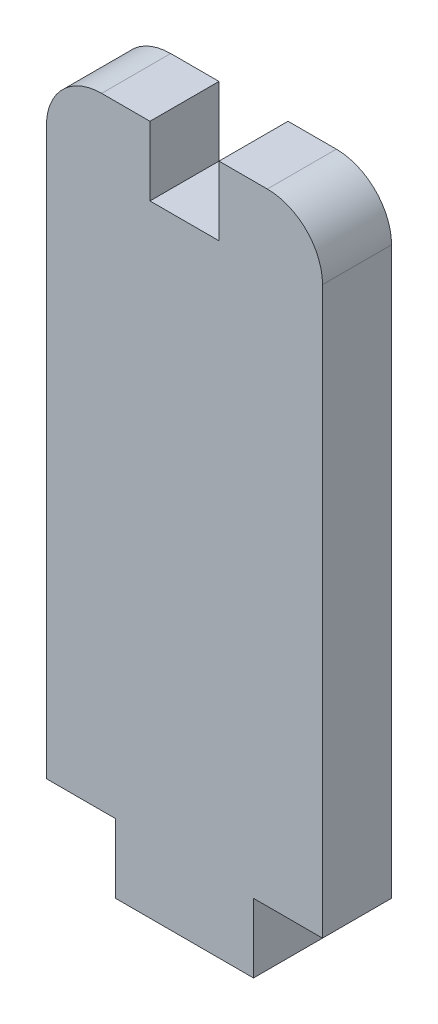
ISO-10303-21;
HEADER;
FILE_DESCRIPTION(('STEP AP214'),'2;1');
FILE_NAME('part.step','',(''),(''),'','','');
FILE_SCHEMA(('AUTOMOTIVE_DESIGN { 1 0 10303 214 1 1 1 1 }'));
ENDSEC;
DATA;
#1=APPLICATION_CONTEXT('core data for automotive mechanical design processes');
#2=APPLICATION_PROTOCOL_DEFINITION('international standard','automotive_design',2000,#1);
#3=PRODUCT_CONTEXT('',#1,'mechanical');
#4=PRODUCT('Part','Part','',(#3));
#5=PRODUCT_RELATED_PRODUCT_CATEGORY('part','',(#4));
#6=PRODUCT_DEFINITION_FORMATION('','',#4);
#7=PRODUCT_DEFINITION_CONTEXT('part definition',#1,'design');
#8=PRODUCT_DEFINITION('design','',#6,#7);
#9=PRODUCT_DEFINITION_SHAPE('','',#8);
#10=(LENGTH_UNIT() NAMED_UNIT(*) SI_UNIT(.MILLI.,.METRE.));
#11=(NAMED_UNIT(*) PLANE_ANGLE_UNIT() SI_UNIT($,.RADIAN.));
#12=(NAMED_UNIT(*) SI_UNIT($,.STERADIAN.) SOLID_ANGLE_UNIT());
#13=UNCERTAINTY_MEASURE_WITH_UNIT(LENGTH_MEASURE(1.E-05),#10,'distance_accuracy_value','');
#14=(GEOMETRIC_REPRESENTATION_CONTEXT(3) GLOBAL_UNCERTAINTY_ASSIGNED_CONTEXT((#13)) GLOBAL_UNIT_ASSIGNED_CONTEXT((#10,
#11,#12)) REPRESENTATION_CONTEXT('',''));
#15=CARTESIAN_POINT('',(0.,0.,0.));
#16=DIRECTION('',(0.,0.,1.));
#17=DIRECTION('',(1.,0.,0.));
#18=AXIS2_PLACEMENT_3D('',#15,#16,#17);
#19=CARTESIAN_POINT('',(-6.35,15.875,1.5875));
#20=DIRECTION('',(0.,-1.,0.));
#21=DIRECTION('',(0.,0.,-1.));
#22=AXIS2_PLACEMENT_3D('',#19,#20,#21);
#23=PLANE('',#22);
#24=DIRECTION('',(-1.,0.,0.));
#25=VECTOR('',#24,1.);
#26=CARTESIAN_POINT('',(-6.35,15.875,1.5875));
#27=LINE('',#26,#25);
#28=CARTESIAN_POINT('',(3.81,15.875,1.5875));
#29=VERTEX_POINT('',#28);
#30=CARTESIAN_POINT('',(1.5875,15.875,1.5875));
#31=VERTEX_POINT('',#30);
#32=EDGE_CURVE('E217',#29,#31,#27,.T.);
#33=ORIENTED_EDGE('',*,*,#32,.F.);
#34=DIRECTION('',(0.,0.,-1.));
#35=VECTOR('',#34,1.);
#36=CARTESIAN_POINT('',(3.81,15.875,1.5875));
#37=LINE('',#36,#35);
#38=CARTESIAN_POINT('',(3.81,15.875,-1.5875));
#39=VERTEX_POINT('',#38);
#40=EDGE_CURVE('E138',#29,#39,#37,.T.);
#41=ORIENTED_EDGE('',*,*,#40,.T.);
#42=DIRECTION('',(-1.,0.,0.));
#43=VECTOR('',#42,1.);
#44=CARTESIAN_POINT('',(-6.35,15.875,-1.5875));
#45=LINE('',#44,#43);
#46=CARTESIAN_POINT('',(1.5875,15.875,-1.5875));
#47=VERTEX_POINT('',#46);
#48=EDGE_CURVE('E133',#39,#47,#45,.T.);
#49=ORIENTED_EDGE('',*,*,#48,.T.);
#50=DIRECTION('',(0.,0.,1.));
#51=VECTOR('',#50,1.);
#52=CARTESIAN_POINT('',(1.5875,15.875,-1.5875));
#53=LINE('',#52,#51);
#54=EDGE_CURVE('E136',#47,#31,#53,.T.);
#55=ORIENTED_EDGE('',*,*,#54,.T.);
#56=EDGE_LOOP('',(#33,#41,#49,#55));
#57=FACE_BOUND('',#56,.T.);
#58=ADVANCED_FACE('F31',(#57),#23,.F.);
#59=CARTESIAN_POINT('',(6.35,15.875,1.5875));
#60=DIRECTION('',(-1.,0.,0.));
#61=DIRECTION('',(0.,-1.,0.));
#62=AXIS2_PLACEMENT_3D('',#59,#60,#61);
#63=PLANE('',#62);
#64=DIRECTION('',(0.,1.,0.));
#65=VECTOR('',#64,1.);
#66=CARTESIAN_POINT('',(6.35,15.875,-1.5875));
#67=LINE('',#66,#65);
#68=CARTESIAN_POINT('',(6.35,-12.7,-1.5875));
#69=VERTEX_POINT('',#68);
#70=CARTESIAN_POINT('',(6.35,13.335,-1.5875));
#71=VERTEX_POINT('',#70);
#72=EDGE_CURVE('E208',#69,#71,#67,.T.);
#73=ORIENTED_EDGE('',*,*,#72,.T.);
#74=DIRECTION('',(0.,0.,-1.));
#75=VECTOR('',#74,1.);
#76=CARTESIAN_POINT('',(6.35,13.335,1.5875));
#77=LINE('',#76,#75);
#78=CARTESIAN_POINT('',(6.35,13.335,1.5875));
#79=VERTEX_POINT('',#78);
#80=EDGE_CURVE('E234',#71,#79,#77,.F.);
#81=ORIENTED_EDGE('',*,*,#80,.T.);
#82=DIRECTION('',(0.,1.,0.));
#83=VECTOR('',#82,1.);
#84=CARTESIAN_POINT('',(6.35,15.875,1.5875));
#85=LINE('',#84,#83);
#86=CARTESIAN_POINT('',(6.35,-12.7,1.5875));
#87=VERTEX_POINT('',#86);
#88=EDGE_CURVE('E212',#87,#79,#85,.T.);
#89=ORIENTED_EDGE('',*,*,#88,.F.);
#90=DIRECTION('',(0.,0.,1.));
#91=VECTOR('',#90,1.);
#92=CARTESIAN_POINT('',(6.35,-12.7,-1.5875));
#93=LINE('',#92,#91);
#94=EDGE_CURVE('E182',#69,#87,#93,.T.);
#95=ORIENTED_EDGE('',*,*,#94,.F.);
#96=EDGE_LOOP('',(#73,#81,#89,#95));
#97=FACE_BOUND('',#96,.T.);
#98=ADVANCED_FACE('F273',(#97),#63,.F.);
#99=CARTESIAN_POINT('',(-1.5875,15.875,-1.5875));
#100=VERTEX_POINT('',#99);
#101=CARTESIAN_POINT('',(-3.81,15.875,-1.5875));
#102=VERTEX_POINT('',#101);
#103=EDGE_CURVE('E142',#100,#102,#45,.T.);
#104=ORIENTED_EDGE('',*,*,#103,.T.);
#105=DIRECTION('',(0.,0.,-1.));
#106=VECTOR('',#105,1.);
#107=CARTESIAN_POINT('',(-3.81,15.875,1.5875));
#108=LINE('',#107,#106);
#109=CARTESIAN_POINT('',(-3.81,15.875,1.5875));
#110=VERTEX_POINT('',#109);
#111=EDGE_CURVE('E11',#102,#110,#108,.F.);
#112=ORIENTED_EDGE('',*,*,#111,.T.);
#113=CARTESIAN_POINT('',(-1.5875,15.875,1.5875));
#114=VERTEX_POINT('',#113);
#115=EDGE_CURVE('E215',#114,#110,#27,.T.);
#116=ORIENTED_EDGE('',*,*,#115,.F.);
#117=DIRECTION('',(0.,0.,1.));
#118=VECTOR('',#117,1.);
#119=CARTESIAN_POINT('',(-1.5875,15.875,-1.5875));
#120=LINE('',#119,#118);
#121=EDGE_CURVE('E152',#100,#114,#120,.T.);
#122=ORIENTED_EDGE('',*,*,#121,.F.);
#123=EDGE_LOOP('',(#104,#112,#116,#122));
#124=FACE_BOUND('',#123,.T.);
#125=ADVANCED_FACE('F275',(#124),#23,.F.);
#126=CARTESIAN_POINT('',(-6.35,15.875,1.5875));
#127=DIRECTION('',(1.,0.,0.));
#128=DIRECTION('',(0.,1.,0.));
#129=AXIS2_PLACEMENT_3D('',#126,#127,#128);
#130=PLANE('',#129);
#131=DIRECTION('',(0.,-1.,0.));
#132=VECTOR('',#131,1.);
#133=CARTESIAN_POINT('',(-6.35,15.875,1.5875));
#134=LINE('',#133,#132);
#135=CARTESIAN_POINT('',(-6.35,13.335,1.5875));
#136=VERTEX_POINT('',#135);
#137=CARTESIAN_POINT('',(-6.35,-12.7,1.5875));
#138=VERTEX_POINT('',#137);
#139=EDGE_CURVE('E219',#136,#138,#134,.T.);
#140=ORIENTED_EDGE('',*,*,#139,.F.);
#141=DIRECTION('',(0.,0.,-1.));
#142=VECTOR('',#141,1.);
#143=CARTESIAN_POINT('',(-6.35,13.335,1.5875));
#144=LINE('',#143,#142);
#145=CARTESIAN_POINT('',(-6.35,13.335,-1.5875));
#146=VERTEX_POINT('',#145);
#147=EDGE_CURVE('E39',#136,#146,#144,.T.);
#148=ORIENTED_EDGE('',*,*,#147,.T.);
#149=DIRECTION('',(0.,-1.,0.));
#150=VECTOR('',#149,1.);
#151=CARTESIAN_POINT('',(-6.35,15.875,-1.5875));
#152=LINE('',#151,#150);
#153=CARTESIAN_POINT('',(-6.35,-12.7,-1.5875));
#154=VERTEX_POINT('',#153);
#155=EDGE_CURVE('E141',#146,#154,#152,.T.);
#156=ORIENTED_EDGE('',*,*,#155,.T.);
#157=DIRECTION('',(0.,0.,1.));
#158=VECTOR('',#157,1.);
#159=CARTESIAN_POINT('',(-6.35,-12.7,-1.5875));
#160=LINE('',#159,#158);
#161=EDGE_CURVE('E205',#154,#138,#160,.T.);
#162=ORIENTED_EDGE('',*,*,#161,.T.);
#163=EDGE_LOOP('',(#140,#148,#156,#162));
#164=FACE_BOUND('',#163,.T.);
#165=ADVANCED_FACE('F242',(#164),#130,.F.);
#166=CARTESIAN_POINT('',(-6.35,-15.875,1.5875));
#167=DIRECTION('',(0.,1.,0.));
#168=DIRECTION('',(0.,0.,1.));
#169=AXIS2_PLACEMENT_3D('',#166,#167,#168);
#170=PLANE('',#169);
#171=DIRECTION('',(1.,0.,0.));
#172=VECTOR('',#171,1.);
#173=CARTESIAN_POINT('',(-6.35,-15.875,-1.5875));
#174=LINE('',#173,#172);
#175=CARTESIAN_POINT('',(-3.175,-15.875,-1.5875));
#176=VERTEX_POINT('',#175);
#177=CARTESIAN_POINT('',(3.175,-15.875,-1.5875));
#178=VERTEX_POINT('',#177);
#179=EDGE_CURVE('E216',#176,#178,#174,.T.);
#180=ORIENTED_EDGE('',*,*,#179,.T.);
#181=DIRECTION('',(0.,0.,1.));
#182=VECTOR('',#181,1.);
#183=CARTESIAN_POINT('',(3.175,-15.875,-1.5875));
#184=LINE('',#183,#182);
#185=CARTESIAN_POINT('',(3.175,-15.875,1.5875));
#186=VERTEX_POINT('',#185);
#187=EDGE_CURVE('E186',#178,#186,#184,.T.);
#188=ORIENTED_EDGE('',*,*,#187,.T.);
#189=DIRECTION('',(1.,0.,0.));
#190=VECTOR('',#189,1.);
#191=CARTESIAN_POINT('',(-6.35,-15.875,1.5875));
#192=LINE('',#191,#190);
#193=CARTESIAN_POINT('',(-3.175,-15.875,1.5875));
#194=VERTEX_POINT('',#193);
#195=EDGE_CURVE('E221',#194,#186,#192,.T.);
#196=ORIENTED_EDGE('',*,*,#195,.F.);
#197=DIRECTION('',(0.,0.,1.));
#198=VECTOR('',#197,1.);
#199=CARTESIAN_POINT('',(-3.175,-15.875,-1.5875));
#200=LINE('',#199,#198);
#201=EDGE_CURVE('E200',#176,#194,#200,.T.);
#202=ORIENTED_EDGE('',*,*,#201,.F.);
#203=EDGE_LOOP('',(#180,#188,#196,#202));
#204=FACE_BOUND('',#203,.T.);
#205=ADVANCED_FACE('F261',(#204),#170,.F.);
#206=CARTESIAN_POINT('',(6.35,-15.875,1.5875));
#207=DIRECTION('',(0.,0.,1.));
#208=DIRECTION('',(1.,0.,0.));
#209=AXIS2_PLACEMENT_3D('',#206,#207,#208);
#210=PLANE('',#209);
#211=ORIENTED_EDGE('',*,*,#88,.T.);
#212=CARTESIAN_POINT('',(3.81,13.335,1.5875));
#213=DIRECTION('',(0.,0.,1.));
#214=DIRECTION('',(1.,0.,0.));
#215=AXIS2_PLACEMENT_3D('',#212,#213,#214);
#216=CIRCLE('',#215,2.54);
#217=EDGE_CURVE('E237',#79,#29,#216,.T.);
#218=ORIENTED_EDGE('',*,*,#217,.T.);
#219=ORIENTED_EDGE('',*,*,#32,.T.);
#220=DIRECTION('',(0.,1.,0.));
#221=VECTOR('',#220,1.);
#222=CARTESIAN_POINT('',(1.5875,15.875,1.5875));
#223=LINE('',#222,#221);
#224=CARTESIAN_POINT('',(1.5875,12.7,1.5875));
#225=VERTEX_POINT('',#224);
#226=EDGE_CURVE('E151',#225,#31,#223,.T.);
#227=ORIENTED_EDGE('',*,*,#226,.F.);
#228=DIRECTION('',(1.,0.,0.));
#229=VECTOR('',#228,1.);
#230=CARTESIAN_POINT('',(-1.5875,12.7,1.5875));
#231=LINE('',#230,#229);
#232=CARTESIAN_POINT('',(-1.5875,12.7,1.5875));
#233=VERTEX_POINT('',#232);
#234=EDGE_CURVE('E158',#233,#225,#231,.T.);
#235=ORIENTED_EDGE('',*,*,#234,.F.);
#236=DIRECTION('',(0.,-1.,0.));
#237=VECTOR('',#236,1.);
#238=CARTESIAN_POINT('',(-1.5875,15.875,1.5875));
#239=LINE('',#238,#237);
#240=EDGE_CURVE('E162',#114,#233,#239,.T.);
#241=ORIENTED_EDGE('',*,*,#240,.F.);
#242=ORIENTED_EDGE('',*,*,#115,.T.);
#243=CARTESIAN_POINT('',(-3.81,13.335,1.5875));
#244=DIRECTION('',(0.,0.,1.));
#245=DIRECTION('',(1.,0.,0.));
#246=AXIS2_PLACEMENT_3D('',#243,#244,#245);
#247=CIRCLE('',#246,2.54);
#248=EDGE_CURVE('E46',#110,#136,#247,.T.);
#249=ORIENTED_EDGE('',*,*,#248,.T.);
#250=ORIENTED_EDGE('',*,*,#139,.T.);
#251=DIRECTION('',(-1.,0.,0.));
#252=VECTOR('',#251,1.);
#253=CARTESIAN_POINT('',(-6.35,-12.7,1.5875));
#254=LINE('',#253,#252);
#255=CARTESIAN_POINT('',(-3.175,-12.7,1.5875));
#256=VERTEX_POINT('',#255);
#257=EDGE_CURVE('E197',#256,#138,#254,.T.);
#258=ORIENTED_EDGE('',*,*,#257,.F.);
#259=DIRECTION('',(0.,1.,0.));
#260=VECTOR('',#259,1.);
#261=CARTESIAN_POINT('',(-3.175,-15.875,1.5875));
#262=LINE('',#261,#260);
#263=EDGE_CURVE('E189',#194,#256,#262,.T.);
#264=ORIENTED_EDGE('',*,*,#263,.F.);
#265=ORIENTED_EDGE('',*,*,#195,.T.);
#266=DIRECTION('',(0.,-1.,0.));
#267=VECTOR('',#266,1.);
#268=CARTESIAN_POINT('',(3.175,-15.875,1.5875));
#269=LINE('',#268,#267);
#270=CARTESIAN_POINT('',(3.175,-12.7,1.5875));
#271=VERTEX_POINT('',#270);
#272=EDGE_CURVE('E179',#271,#186,#269,.T.);
#273=ORIENTED_EDGE('',*,*,#272,.F.);
#274=DIRECTION('',(-1.,0.,0.));
#275=VECTOR('',#274,1.);
#276=CARTESIAN_POINT('',(6.35,-12.7,1.5875));
#277=LINE('',#276,#275);
#278=EDGE_CURVE('E171',#87,#271,#277,.T.);
#279=ORIENTED_EDGE('',*,*,#278,.F.);
#280=EDGE_LOOP('',(#211,#218,#219,#227,#235,#241,#242,#249,#250,#258,#264,#265,#273,#279));
#281=FACE_BOUND('',#280,.T.);
#282=ADVANCED_FACE('F256',(#281),#210,.T.);
#283=CARTESIAN_POINT('',(6.35,-15.875,-1.5875));
#284=DIRECTION('',(0.,0.,1.));
#285=DIRECTION('',(1.,0.,0.));
#286=AXIS2_PLACEMENT_3D('',#283,#284,#285);
#287=PLANE('',#286);
#288=ORIENTED_EDGE('',*,*,#48,.F.);
#289=CARTESIAN_POINT('',(3.81,13.335,-1.5875));
#290=DIRECTION('',(0.,0.,1.));
#291=DIRECTION('',(1.,0.,0.));
#292=AXIS2_PLACEMENT_3D('',#289,#290,#291);
#293=CIRCLE('',#292,2.54);
#294=EDGE_CURVE('E232',#39,#71,#293,.F.);
#295=ORIENTED_EDGE('',*,*,#294,.T.);
#296=ORIENTED_EDGE('',*,*,#72,.F.);
#297=DIRECTION('',(-1.,0.,0.));
#298=VECTOR('',#297,1.);
#299=CARTESIAN_POINT('',(6.35,-12.7,-1.5875));
#300=LINE('',#299,#298);
#301=CARTESIAN_POINT('',(3.175,-12.7,-1.5875));
#302=VERTEX_POINT('',#301);
#303=EDGE_CURVE('E175',#69,#302,#300,.T.);
#304=ORIENTED_EDGE('',*,*,#303,.T.);
#305=DIRECTION('',(0.,-1.,0.));
#306=VECTOR('',#305,1.);
#307=CARTESIAN_POINT('',(3.175,-15.875,-1.5875));
#308=LINE('',#307,#306);
#309=EDGE_CURVE('E178',#302,#178,#308,.T.);
#310=ORIENTED_EDGE('',*,*,#309,.T.);
#311=ORIENTED_EDGE('',*,*,#179,.F.);
#312=DIRECTION('',(0.,1.,0.));
#313=VECTOR('',#312,1.);
#314=CARTESIAN_POINT('',(-3.175,-15.875,-1.5875));
#315=LINE('',#314,#313);
#316=CARTESIAN_POINT('',(-3.175,-12.7,-1.5875));
#317=VERTEX_POINT('',#316);
#318=EDGE_CURVE('E193',#176,#317,#315,.T.);
#319=ORIENTED_EDGE('',*,*,#318,.T.);
#320=DIRECTION('',(-1.,0.,0.));
#321=VECTOR('',#320,1.);
#322=CARTESIAN_POINT('',(-6.35,-12.7,-1.5875));
#323=LINE('',#322,#321);
#324=EDGE_CURVE('E196',#317,#154,#323,.T.);
#325=ORIENTED_EDGE('',*,*,#324,.T.);
#326=ORIENTED_EDGE('',*,*,#155,.F.);
#327=CARTESIAN_POINT('',(-3.81,13.335,-1.5875));
#328=DIRECTION('',(0.,0.,1.));
#329=DIRECTION('',(1.,0.,0.));
#330=AXIS2_PLACEMENT_3D('',#327,#328,#329);
#331=CIRCLE('',#330,2.54);
#332=EDGE_CURVE('E230',#146,#102,#331,.F.);
#333=ORIENTED_EDGE('',*,*,#332,.T.);
#334=ORIENTED_EDGE('',*,*,#103,.F.);
#335=DIRECTION('',(0.,-1.,0.));
#336=VECTOR('',#335,1.);
#337=CARTESIAN_POINT('',(-1.5875,15.875,-1.5875));
#338=LINE('',#337,#336);
#339=CARTESIAN_POINT('',(-1.5875,12.7,-1.5875));
#340=VERTEX_POINT('',#339);
#341=EDGE_CURVE('E157',#100,#340,#338,.T.);
#342=ORIENTED_EDGE('',*,*,#341,.T.);
#343=DIRECTION('',(1.,0.,0.));
#344=VECTOR('',#343,1.);
#345=CARTESIAN_POINT('',(-1.5875,12.7,-1.5875));
#346=LINE('',#345,#344);
#347=CARTESIAN_POINT('',(1.5875,12.7,-1.5875));
#348=VERTEX_POINT('',#347);
#349=EDGE_CURVE('E153',#340,#348,#346,.T.);
#350=ORIENTED_EDGE('',*,*,#349,.T.);
#351=DIRECTION('',(0.,1.,0.));
#352=VECTOR('',#351,1.);
#353=CARTESIAN_POINT('',(1.5875,15.875,-1.5875));
#354=LINE('',#353,#352);
#355=EDGE_CURVE('E148',#348,#47,#354,.T.);
#356=ORIENTED_EDGE('',*,*,#355,.T.);
#357=EDGE_LOOP('',(#288,#295,#296,#304,#310,#311,#319,#325,#326,#333,#334,#342,#350,#356));
#358=FACE_BOUND('',#357,.T.);
#359=ADVANCED_FACE('F155',(#358),#287,.F.);
#360=CARTESIAN_POINT('',(-6.35,-12.7,-1.5875));
#361=DIRECTION('',(0.,1.,0.));
#362=DIRECTION('',(0.,0.,1.));
#363=AXIS2_PLACEMENT_3D('',#360,#361,#362);
#364=PLANE('',#363);
#365=ORIENTED_EDGE('',*,*,#257,.T.);
#366=ORIENTED_EDGE('',*,*,#161,.F.);
#367=ORIENTED_EDGE('',*,*,#324,.F.);
#368=DIRECTION('',(0.,0.,1.));
#369=VECTOR('',#368,1.);
#370=CARTESIAN_POINT('',(-3.175,-12.7,-1.5875));
#371=LINE('',#370,#369);
#372=EDGE_CURVE('E209',#317,#256,#371,.T.);
#373=ORIENTED_EDGE('',*,*,#372,.T.);
#374=EDGE_LOOP('',(#365,#366,#367,#373));
#375=FACE_BOUND('',#374,.T.);
#376=ADVANCED_FACE('F249',(#375),#364,.F.);
#377=CARTESIAN_POINT('',(-3.175,-15.875,-1.5875));
#378=DIRECTION('',(1.,0.,0.));
#379=DIRECTION('',(0.,0.,-1.));
#380=AXIS2_PLACEMENT_3D('',#377,#378,#379);
#381=PLANE('',#380);
#382=ORIENTED_EDGE('',*,*,#263,.T.);
#383=ORIENTED_EDGE('',*,*,#372,.F.);
#384=ORIENTED_EDGE('',*,*,#318,.F.);
#385=ORIENTED_EDGE('',*,*,#201,.T.);
#386=EDGE_LOOP('',(#382,#383,#384,#385));
#387=FACE_BOUND('',#386,.T.);
#388=ADVANCED_FACE('F251',(#387),#381,.F.);
#389=CARTESIAN_POINT('',(3.175,-15.875,-1.5875));
#390=DIRECTION('',(-1.,0.,0.));
#391=DIRECTION('',(0.,0.,1.));
#392=AXIS2_PLACEMENT_3D('',#389,#390,#391);
#393=PLANE('',#392);
#394=ORIENTED_EDGE('',*,*,#272,.T.);
#395=ORIENTED_EDGE('',*,*,#187,.F.);
#396=ORIENTED_EDGE('',*,*,#309,.F.);
#397=DIRECTION('',(0.,0.,1.));
#398=VECTOR('',#397,1.);
#399=CARTESIAN_POINT('',(3.175,-12.7,-1.5875));
#400=LINE('',#399,#398);
#401=EDGE_CURVE('E190',#302,#271,#400,.T.);
#402=ORIENTED_EDGE('',*,*,#401,.T.);
#403=EDGE_LOOP('',(#394,#395,#396,#402));
#404=FACE_BOUND('',#403,.T.);
#405=ADVANCED_FACE('F313',(#404),#393,.F.);
#406=CARTESIAN_POINT('',(6.35,-12.7,-1.5875));
#407=DIRECTION('',(0.,1.,0.));
#408=DIRECTION('',(0.,0.,1.));
#409=AXIS2_PLACEMENT_3D('',#406,#407,#408);
#410=PLANE('',#409);
#411=ORIENTED_EDGE('',*,*,#278,.T.);
#412=ORIENTED_EDGE('',*,*,#401,.F.);
#413=ORIENTED_EDGE('',*,*,#303,.F.);
#414=ORIENTED_EDGE('',*,*,#94,.T.);
#415=EDGE_LOOP('',(#411,#412,#413,#414));
#416=FACE_BOUND('',#415,.T.);
#417=ADVANCED_FACE('F310',(#416),#410,.F.);
#418=CARTESIAN_POINT('',(1.5875,15.875,-1.5875));
#419=DIRECTION('',(1.,0.,0.));
#420=DIRECTION('',(0.,1.,0.));
#421=AXIS2_PLACEMENT_3D('',#418,#419,#420);
#422=PLANE('',#421);
#423=ORIENTED_EDGE('',*,*,#226,.T.);
#424=ORIENTED_EDGE('',*,*,#54,.F.);
#425=ORIENTED_EDGE('',*,*,#355,.F.);
#426=DIRECTION('',(0.,0.,1.));
#427=VECTOR('',#426,1.);
#428=CARTESIAN_POINT('',(1.5875,12.7,-1.5875));
#429=LINE('',#428,#427);
#430=EDGE_CURVE('E169',#348,#225,#429,.T.);
#431=ORIENTED_EDGE('',*,*,#430,.T.);
#432=EDGE_LOOP('',(#423,#424,#425,#431));
#433=FACE_BOUND('',#432,.T.);
#434=ADVANCED_FACE('F147',(#433),#422,.F.);
#435=CARTESIAN_POINT('',(-1.5875,12.7,-1.5875));
#436=DIRECTION('',(0.,-1.,0.));
#437=DIRECTION('',(0.,0.,-1.));
#438=AXIS2_PLACEMENT_3D('',#435,#436,#437);
#439=PLANE('',#438);
#440=ORIENTED_EDGE('',*,*,#234,.T.);
#441=ORIENTED_EDGE('',*,*,#430,.F.);
#442=ORIENTED_EDGE('',*,*,#349,.F.);
#443=DIRECTION('',(0.,0.,1.));
#444=VECTOR('',#443,1.);
#445=CARTESIAN_POINT('',(-1.5875,12.7,-1.5875));
#446=LINE('',#445,#444);
#447=EDGE_CURVE('E172',#340,#233,#446,.T.);
#448=ORIENTED_EDGE('',*,*,#447,.T.);
#449=EDGE_LOOP('',(#440,#441,#442,#448));
#450=FACE_BOUND('',#449,.T.);
#451=ADVANCED_FACE('F297',(#450),#439,.F.);
#452=CARTESIAN_POINT('',(-1.5875,15.875,-1.5875));
#453=DIRECTION('',(-1.,0.,0.));
#454=DIRECTION('',(0.,-1.,0.));
#455=AXIS2_PLACEMENT_3D('',#452,#453,#454);
#456=PLANE('',#455);
#457=ORIENTED_EDGE('',*,*,#240,.T.);
#458=ORIENTED_EDGE('',*,*,#447,.F.);
#459=ORIENTED_EDGE('',*,*,#341,.F.);
#460=ORIENTED_EDGE('',*,*,#121,.T.);
#461=EDGE_LOOP('',(#457,#458,#459,#460));
#462=FACE_BOUND('',#461,.T.);
#463=ADVANCED_FACE('F292',(#462),#456,.F.);
#464=CARTESIAN_POINT('',(3.81,13.335,1.5875));
#465=DIRECTION('',(0.,0.,-1.));
#466=DIRECTION('',(-1.,0.,0.));
#467=AXIS2_PLACEMENT_3D('',#464,#465,#466);
#468=CYLINDRICAL_SURFACE('',#467,2.54);
#469=ORIENTED_EDGE('',*,*,#217,.F.);
#470=ORIENTED_EDGE('',*,*,#80,.F.);
#471=ORIENTED_EDGE('',*,*,#294,.F.);
#472=ORIENTED_EDGE('',*,*,#40,.F.);
#473=EDGE_LOOP('',(#469,#470,#471,#472));
#474=FACE_BOUND('',#473,.T.);
#475=ADVANCED_FACE('F288',(#474),#468,.T.);
#476=CARTESIAN_POINT('',(-3.81,13.335,1.5875));
#477=DIRECTION('',(0.,0.,-1.));
#478=DIRECTION('',(-1.,0.,0.));
#479=AXIS2_PLACEMENT_3D('',#476,#477,#478);
#480=CYLINDRICAL_SURFACE('',#479,2.54);
#481=ORIENTED_EDGE('',*,*,#248,.F.);
#482=ORIENTED_EDGE('',*,*,#111,.F.);
#483=ORIENTED_EDGE('',*,*,#332,.F.);
#484=ORIENTED_EDGE('',*,*,#147,.F.);
#485=EDGE_LOOP('',(#481,#482,#483,#484));
#486=FACE_BOUND('',#485,.T.);
#487=ADVANCED_FACE('F33',(#486),#480,.T.);
#488=CLOSED_SHELL('',(#58,#98,#125,#165,#205,#282,#359,#376,#388,#405,#417,#434,#451,#463,#475,#487));
#489=MANIFOLD_SOLID_BREP('B2',#488);
#490=ADVANCED_BREP_SHAPE_REPRESENTATION('',(#18,#489),#14);
#491=SHAPE_DEFINITION_REPRESENTATION(#9,#490);
ENDSEC;
END-ISO-10303-21;
